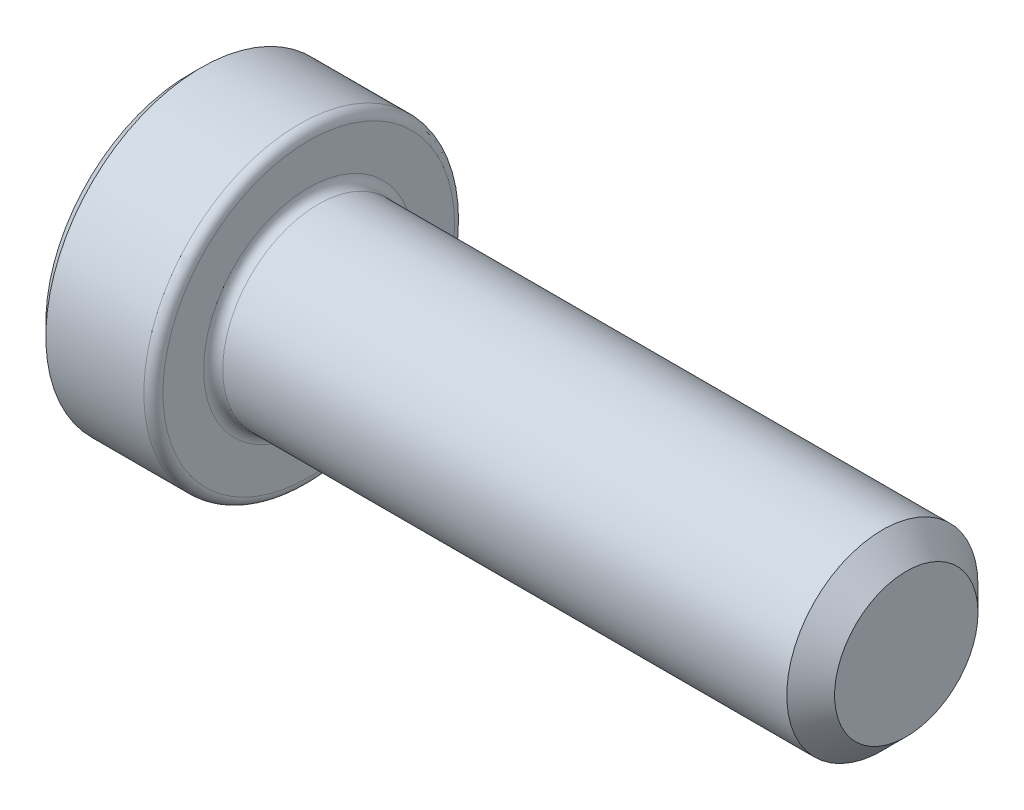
ISO-10303-21;
HEADER;
FILE_DESCRIPTION(('STEP AP214'),'2;1');
FILE_NAME('part.step','',(''),(''),'','','');
FILE_SCHEMA(('AUTOMOTIVE_DESIGN { 1 0 10303 214 1 1 1 1 }'));
ENDSEC;
DATA;
#1=APPLICATION_CONTEXT('core data for automotive mechanical design processes');
#2=APPLICATION_PROTOCOL_DEFINITION('international standard','automotive_design',2000,#1);
#3=PRODUCT_CONTEXT('',#1,'mechanical');
#4=PRODUCT('Part','Part','',(#3));
#5=PRODUCT_RELATED_PRODUCT_CATEGORY('part','',(#4));
#6=PRODUCT_DEFINITION_FORMATION('','',#4);
#7=PRODUCT_DEFINITION_CONTEXT('part definition',#1,'design');
#8=PRODUCT_DEFINITION('design','',#6,#7);
#9=PRODUCT_DEFINITION_SHAPE('','',#8);
#10=(LENGTH_UNIT() NAMED_UNIT(*) SI_UNIT(.MILLI.,.METRE.));
#11=(NAMED_UNIT(*) PLANE_ANGLE_UNIT() SI_UNIT($,.RADIAN.));
#12=(NAMED_UNIT(*) SI_UNIT($,.STERADIAN.) SOLID_ANGLE_UNIT());
#13=UNCERTAINTY_MEASURE_WITH_UNIT(LENGTH_MEASURE(1.E-05),#10,'distance_accuracy_value','');
#14=(GEOMETRIC_REPRESENTATION_CONTEXT(3) GLOBAL_UNCERTAINTY_ASSIGNED_CONTEXT((#13)) GLOBAL_UNIT_ASSIGNED_CONTEXT((#10,
#11,#12)) REPRESENTATION_CONTEXT('',''));
#15=CARTESIAN_POINT('',(0.,0.,0.));
#16=DIRECTION('',(0.,0.,1.));
#17=DIRECTION('',(1.,0.,0.));
#18=AXIS2_PLACEMENT_3D('',#15,#16,#17);
#19=CARTESIAN_POINT('',(-30.,0.,0.));
#20=DIRECTION('',(1.,0.,0.));
#21=DIRECTION('',(0.,0.,-1.));
#22=AXIS2_PLACEMENT_3D('',#19,#20,#21);
#23=PLANE('',#22);
#24=DIRECTION('',(0.,-0.866025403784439,0.5));
#25=VECTOR('',#24,1.);
#26=CARTESIAN_POINT('',(-30.,-3.,-1.73205080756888));
#27=LINE('',#26,#25);
#28=CARTESIAN_POINT('',(-30.,0.,-3.46410161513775));
#29=VERTEX_POINT('',#28);
#30=CARTESIAN_POINT('',(-30.,-3.,-1.73205080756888));
#31=VERTEX_POINT('',#30);
#32=EDGE_CURVE('E115',#29,#31,#27,.T.);
#33=ORIENTED_EDGE('',*,*,#32,.F.);
#34=DIRECTION('',(0.,-0.866025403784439,-0.5));
#35=VECTOR('',#34,1.);
#36=CARTESIAN_POINT('',(-30.,0.,-3.46410161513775));
#37=LINE('',#36,#35);
#38=CARTESIAN_POINT('',(-30.,3.,-1.73205080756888));
#39=VERTEX_POINT('',#38);
#40=EDGE_CURVE('E120',#39,#29,#37,.T.);
#41=ORIENTED_EDGE('',*,*,#40,.F.);
#42=DIRECTION('',(0.,0.,-1.));
#43=VECTOR('',#42,1.);
#44=CARTESIAN_POINT('',(-30.,3.,-1.73205080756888));
#45=LINE('',#44,#43);
#46=CARTESIAN_POINT('',(-30.,3.,1.73205080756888));
#47=VERTEX_POINT('',#46);
#48=EDGE_CURVE('E133',#47,#39,#45,.T.);
#49=ORIENTED_EDGE('',*,*,#48,.F.);
#50=DIRECTION('',(0.,0.866025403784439,-0.5));
#51=VECTOR('',#50,1.);
#52=CARTESIAN_POINT('',(-30.,3.,1.73205080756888));
#53=LINE('',#52,#51);
#54=CARTESIAN_POINT('',(-30.,0.,3.46410161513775));
#55=VERTEX_POINT('',#54);
#56=EDGE_CURVE('E127',#55,#47,#53,.T.);
#57=ORIENTED_EDGE('',*,*,#56,.F.);
#58=DIRECTION('',(0.,0.866025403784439,0.5));
#59=VECTOR('',#58,1.);
#60=CARTESIAN_POINT('',(-30.,0.,3.46410161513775));
#61=LINE('',#60,#59);
#62=CARTESIAN_POINT('',(-30.,-3.,1.73205080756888));
#63=VERTEX_POINT('',#62);
#64=EDGE_CURVE('E125',#63,#55,#61,.T.);
#65=ORIENTED_EDGE('',*,*,#64,.F.);
#66=DIRECTION('',(0.,0.,1.));
#67=VECTOR('',#66,1.);
#68=CARTESIAN_POINT('',(-30.,-3.,1.73205080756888));
#69=LINE('',#68,#67);
#70=EDGE_CURVE('E105',#31,#63,#69,.T.);
#71=ORIENTED_EDGE('',*,*,#70,.F.);
#72=EDGE_LOOP('',(#33,#41,#49,#57,#65,#71));
#73=FACE_BOUND('',#72,.T.);
#74=CARTESIAN_POINT('',(-30.,0.,0.));
#75=DIRECTION('',(1.,0.,0.));
#76=DIRECTION('',(0.,0.,-1.));
#77=AXIS2_PLACEMENT_3D('',#74,#75,#76);
#78=CIRCLE('',#77,6.);
#79=CARTESIAN_POINT('',(-30.,0.,-6.));
#80=VERTEX_POINT('',#79);
#81=EDGE_CURVE('E165',#80,#80,#78,.T.);
#82=ORIENTED_EDGE('',*,*,#81,.F.);
#83=EDGE_LOOP('',(#82));
#84=FACE_BOUND('',#83,.T.);
#85=ADVANCED_FACE('F32',(#73,#84),#23,.F.);
#86=CARTESIAN_POINT('',(-30.,0.,0.));
#87=DIRECTION('',(1.,0.,0.));
#88=DIRECTION('',(0.,0.,-1.));
#89=AXIS2_PLACEMENT_3D('',#86,#87,#88);
#90=CONICAL_SURFACE('',#89,6.,0.785398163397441);
#91=CARTESIAN_POINT('',(-29.5,0.,0.));
#92=DIRECTION('',(1.,0.,0.));
#93=DIRECTION('',(0.,0.,-1.));
#94=AXIS2_PLACEMENT_3D('',#91,#92,#93);
#95=CIRCLE('',#94,6.5);
#96=CARTESIAN_POINT('',(-29.5,0.,-6.5));
#97=VERTEX_POINT('',#96);
#98=EDGE_CURVE('E162',#97,#97,#95,.T.);
#99=ORIENTED_EDGE('',*,*,#98,.F.);
#100=EDGE_LOOP('',(#99));
#101=FACE_BOUND('',#100,.T.);
#102=ORIENTED_EDGE('',*,*,#81,.T.);
#103=EDGE_LOOP('',(#102));
#104=FACE_BOUND('',#103,.T.);
#105=ADVANCED_FACE('F249',(#101,#104),#90,.T.);
#106=CARTESIAN_POINT('',(0.,0.,0.));
#107=DIRECTION('',(1.,0.,0.));
#108=DIRECTION('',(0.,0.,-1.));
#109=AXIS2_PLACEMENT_3D('',#106,#107,#108);
#110=CYLINDRICAL_SURFACE('',#109,6.5);
#111=CARTESIAN_POINT('',(-25.4,0.,0.));
#112=DIRECTION('',(1.,0.,0.));
#113=DIRECTION('',(0.,0.,-1.));
#114=AXIS2_PLACEMENT_3D('',#111,#112,#113);
#115=CIRCLE('',#114,6.5);
#116=CARTESIAN_POINT('',(-25.4,0.,-6.5));
#117=VERTEX_POINT('',#116);
#118=EDGE_CURVE('E159',#117,#117,#115,.T.);
#119=ORIENTED_EDGE('',*,*,#118,.F.);
#120=EDGE_LOOP('',(#119));
#121=FACE_BOUND('',#120,.T.);
#122=ORIENTED_EDGE('',*,*,#98,.T.);
#123=EDGE_LOOP('',(#122));
#124=FACE_BOUND('',#123,.T.);
#125=ADVANCED_FACE('F253',(#121,#124),#110,.T.);
#126=CARTESIAN_POINT('',(-25.4,0.,0.));
#127=DIRECTION('',(1.,0.,0.));
#128=DIRECTION('',(0.,0.,-1.));
#129=AXIS2_PLACEMENT_3D('',#126,#127,#128);
#130=TOROIDAL_SURFACE('',#129,6.1,0.399999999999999);
#131=CARTESIAN_POINT('',(-25.,0.,0.));
#132=DIRECTION('',(1.,0.,0.));
#133=DIRECTION('',(0.,0.,-1.));
#134=AXIS2_PLACEMENT_3D('',#131,#132,#133);
#135=CIRCLE('',#134,6.1);
#136=CARTESIAN_POINT('',(-25.,0.,-6.1));
#137=VERTEX_POINT('',#136);
#138=EDGE_CURVE('E156',#137,#137,#135,.T.);
#139=ORIENTED_EDGE('',*,*,#138,.F.);
#140=EDGE_LOOP('',(#139));
#141=FACE_BOUND('',#140,.T.);
#142=ORIENTED_EDGE('',*,*,#118,.T.);
#143=EDGE_LOOP('',(#142));
#144=FACE_BOUND('',#143,.T.);
#145=ADVANCED_FACE('F258',(#141,#144),#130,.T.);
#146=CARTESIAN_POINT('',(-25.,6.1,0.));
#147=DIRECTION('',(-1.,0.,0.));
#148=DIRECTION('',(0.,0.,1.));
#149=AXIS2_PLACEMENT_3D('',#146,#147,#148);
#150=PLANE('',#149);
#151=CARTESIAN_POINT('',(-25.,0.,0.));
#152=DIRECTION('',(1.,0.,0.));
#153=DIRECTION('',(0.,0.,-1.));
#154=AXIS2_PLACEMENT_3D('',#151,#152,#153);
#155=CIRCLE('',#154,4.4);
#156=CARTESIAN_POINT('',(-25.,0.,-4.4));
#157=VERTEX_POINT('',#156);
#158=EDGE_CURVE('E153',#157,#157,#155,.T.);
#159=ORIENTED_EDGE('',*,*,#158,.F.);
#160=EDGE_LOOP('',(#159));
#161=FACE_BOUND('',#160,.T.);
#162=ORIENTED_EDGE('',*,*,#138,.T.);
#163=EDGE_LOOP('',(#162));
#164=FACE_BOUND('',#163,.T.);
#165=ADVANCED_FACE('F266',(#161,#164),#150,.F.);
#166=CARTESIAN_POINT('',(-24.6,0.,0.));
#167=DIRECTION('',(1.,0.,0.));
#168=DIRECTION('',(0.,0.,-1.));
#169=AXIS2_PLACEMENT_3D('',#166,#167,#168);
#170=TOROIDAL_SURFACE('',#169,4.4,0.400000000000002);
#171=CARTESIAN_POINT('',(-24.6,0.,0.));
#172=DIRECTION('',(1.,0.,0.));
#173=DIRECTION('',(0.,0.,-1.));
#174=AXIS2_PLACEMENT_3D('',#171,#172,#173);
#175=CIRCLE('',#174,4.);
#176=CARTESIAN_POINT('',(-24.6,0.,-4.));
#177=VERTEX_POINT('',#176);
#178=EDGE_CURVE('E150',#177,#177,#175,.T.);
#179=ORIENTED_EDGE('',*,*,#178,.F.);
#180=EDGE_LOOP('',(#179));
#181=FACE_BOUND('',#180,.T.);
#182=ORIENTED_EDGE('',*,*,#158,.T.);
#183=EDGE_LOOP('',(#182));
#184=FACE_BOUND('',#183,.T.);
#185=ADVANCED_FACE('F270',(#181,#184),#170,.F.);
#186=CARTESIAN_POINT('',(0.,0.,0.));
#187=DIRECTION('',(1.,0.,0.));
#188=DIRECTION('',(0.,0.,-1.));
#189=AXIS2_PLACEMENT_3D('',#186,#187,#188);
#190=CYLINDRICAL_SURFACE('',#189,4.);
#191=CARTESIAN_POINT('',(-1.,0.,0.));
#192=DIRECTION('',(1.,0.,0.));
#193=DIRECTION('',(0.,0.,-1.));
#194=AXIS2_PLACEMENT_3D('',#191,#192,#193);
#195=CIRCLE('',#194,4.);
#196=CARTESIAN_POINT('',(-1.,0.,-4.));
#197=VERTEX_POINT('',#196);
#198=EDGE_CURVE('E147',#197,#197,#195,.T.);
#199=ORIENTED_EDGE('',*,*,#198,.F.);
#200=EDGE_LOOP('',(#199));
#201=FACE_BOUND('',#200,.T.);
#202=ORIENTED_EDGE('',*,*,#178,.T.);
#203=EDGE_LOOP('',(#202));
#204=FACE_BOUND('',#203,.T.);
#205=ADVANCED_FACE('F274',(#201,#204),#190,.T.);
#206=CARTESIAN_POINT('',(-1.,0.,0.));
#207=DIRECTION('',(-1.,0.,0.));
#208=DIRECTION('',(0.,0.,1.));
#209=AXIS2_PLACEMENT_3D('',#206,#207,#208);
#210=CONICAL_SURFACE('',#209,4.,0.785398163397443);
#211=CARTESIAN_POINT('',(0.,0.,0.));
#212=DIRECTION('',(1.,0.,0.));
#213=DIRECTION('',(0.,0.,-1.));
#214=AXIS2_PLACEMENT_3D('',#211,#212,#213);
#215=CIRCLE('',#214,3.00000000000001);
#216=CARTESIAN_POINT('',(0.,0.,-3.00000000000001));
#217=VERTEX_POINT('',#216);
#218=EDGE_CURVE('E138',#217,#217,#215,.T.);
#219=ORIENTED_EDGE('',*,*,#218,.F.);
#220=EDGE_LOOP('',(#219));
#221=FACE_BOUND('',#220,.T.);
#222=ORIENTED_EDGE('',*,*,#198,.T.);
#223=EDGE_LOOP('',(#222));
#224=FACE_BOUND('',#223,.T.);
#225=ADVANCED_FACE('F278',(#221,#224),#210,.T.);
#226=CARTESIAN_POINT('',(0.,3.00000000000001,0.));
#227=DIRECTION('',(-1.,0.,0.));
#228=DIRECTION('',(0.,0.,1.));
#229=AXIS2_PLACEMENT_3D('',#226,#227,#228);
#230=PLANE('',#229);
#231=ORIENTED_EDGE('',*,*,#218,.T.);
#232=EDGE_LOOP('',(#231));
#233=FACE_BOUND('',#232,.T.);
#234=ADVANCED_FACE('F282',(#233),#230,.F.);
#235=CARTESIAN_POINT('',(-27.,0.,-3.46410161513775));
#236=DIRECTION('',(0.,0.5,-0.866025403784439));
#237=DIRECTION('',(0.,0.866025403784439,0.5));
#238=AXIS2_PLACEMENT_3D('',#235,#236,#237);
#239=PLANE('',#238);
#240=DIRECTION('',(-1.,0.,0.));
#241=VECTOR('',#240,1.);
#242=CARTESIAN_POINT('',(-27.,0.,-3.46410161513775));
#243=LINE('',#242,#241);
#244=CARTESIAN_POINT('',(-28.1547005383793,0.,-3.46410161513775));
#245=VERTEX_POINT('',#244);
#246=EDGE_CURVE('E112',#245,#29,#243,.T.);
#247=ORIENTED_EDGE('',*,*,#246,.F.);
#248=DIRECTION('',(0.,0.866025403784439,0.5));
#249=VECTOR('',#248,1.);
#250=CARTESIAN_POINT('',(-28.1547005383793,3.,-1.73205080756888));
#251=LINE('',#250,#249);
#252=CARTESIAN_POINT('',(-28.1547005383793,3.,-1.73205080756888));
#253=VERTEX_POINT('',#252);
#254=EDGE_CURVE('E11',#245,#253,#251,.T.);
#255=ORIENTED_EDGE('',*,*,#254,.T.);
#256=DIRECTION('',(-1.,0.,0.));
#257=VECTOR('',#256,1.);
#258=CARTESIAN_POINT('',(-27.,3.,-1.73205080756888));
#259=LINE('',#258,#257);
#260=EDGE_CURVE('E136',#253,#39,#259,.T.);
#261=ORIENTED_EDGE('',*,*,#260,.T.);
#262=ORIENTED_EDGE('',*,*,#40,.T.);
#263=EDGE_LOOP('',(#247,#255,#261,#262));
#264=FACE_BOUND('',#263,.T.);
#265=ADVANCED_FACE('F220',(#264),#239,.F.);
#266=CARTESIAN_POINT('',(-27.,3.,-1.73205080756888));
#267=DIRECTION('',(0.,1.,0.));
#268=DIRECTION('',(0.,0.,1.));
#269=AXIS2_PLACEMENT_3D('',#266,#267,#268);
#270=PLANE('',#269);
#271=ORIENTED_EDGE('',*,*,#260,.F.);
#272=DIRECTION('',(0.,0.,1.));
#273=VECTOR('',#272,1.);
#274=CARTESIAN_POINT('',(-28.1547005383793,3.,1.73205080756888));
#275=LINE('',#274,#273);
#276=CARTESIAN_POINT('',(-28.1547005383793,3.,1.73205080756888));
#277=VERTEX_POINT('',#276);
#278=EDGE_CURVE('E39',#253,#277,#275,.T.);
#279=ORIENTED_EDGE('',*,*,#278,.T.);
#280=DIRECTION('',(-1.,0.,0.));
#281=VECTOR('',#280,1.);
#282=CARTESIAN_POINT('',(-27.,3.,1.73205080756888));
#283=LINE('',#282,#281);
#284=EDGE_CURVE('E139',#277,#47,#283,.T.);
#285=ORIENTED_EDGE('',*,*,#284,.T.);
#286=ORIENTED_EDGE('',*,*,#48,.T.);
#287=EDGE_LOOP('',(#271,#279,#285,#286));
#288=FACE_BOUND('',#287,.T.);
#289=ADVANCED_FACE('F222',(#288),#270,.F.);
#290=CARTESIAN_POINT('',(-27.,3.,1.73205080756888));
#291=DIRECTION('',(0.,0.5,0.866025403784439));
#292=DIRECTION('',(0.,-0.866025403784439,0.5));
#293=AXIS2_PLACEMENT_3D('',#290,#291,#292);
#294=PLANE('',#293);
#295=ORIENTED_EDGE('',*,*,#284,.F.);
#296=DIRECTION('',(0.,-0.866025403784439,0.5));
#297=VECTOR('',#296,1.);
#298=CARTESIAN_POINT('',(-28.1547005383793,0.,3.46410161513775));
#299=LINE('',#298,#297);
#300=CARTESIAN_POINT('',(-28.1547005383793,0.,3.46410161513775));
#301=VERTEX_POINT('',#300);
#302=EDGE_CURVE('E187',#277,#301,#299,.T.);
#303=ORIENTED_EDGE('',*,*,#302,.T.);
#304=DIRECTION('',(-1.,0.,0.));
#305=VECTOR('',#304,1.);
#306=CARTESIAN_POINT('',(-27.,0.,3.46410161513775));
#307=LINE('',#306,#305);
#308=EDGE_CURVE('E141',#301,#55,#307,.T.);
#309=ORIENTED_EDGE('',*,*,#308,.T.);
#310=ORIENTED_EDGE('',*,*,#56,.T.);
#311=EDGE_LOOP('',(#295,#303,#309,#310));
#312=FACE_BOUND('',#311,.T.);
#313=ADVANCED_FACE('F191',(#312),#294,.F.);
#314=CARTESIAN_POINT('',(-27.,0.,3.46410161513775));
#315=DIRECTION('',(0.,-0.5,0.866025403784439));
#316=DIRECTION('',(0.,-0.866025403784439,-0.5));
#317=AXIS2_PLACEMENT_3D('',#314,#315,#316);
#318=PLANE('',#317);
#319=ORIENTED_EDGE('',*,*,#308,.F.);
#320=DIRECTION('',(0.,-0.866025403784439,-0.5));
#321=VECTOR('',#320,1.);
#322=CARTESIAN_POINT('',(-28.1547005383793,-3.,1.73205080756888));
#323=LINE('',#322,#321);
#324=CARTESIAN_POINT('',(-28.1547005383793,-3.,1.73205080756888));
#325=VERTEX_POINT('',#324);
#326=EDGE_CURVE('E181',#301,#325,#323,.T.);
#327=ORIENTED_EDGE('',*,*,#326,.T.);
#328=DIRECTION('',(-1.,0.,0.));
#329=VECTOR('',#328,1.);
#330=CARTESIAN_POINT('',(-27.,-3.,1.73205080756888));
#331=LINE('',#330,#329);
#332=EDGE_CURVE('E111',#325,#63,#331,.T.);
#333=ORIENTED_EDGE('',*,*,#332,.T.);
#334=ORIENTED_EDGE('',*,*,#64,.T.);
#335=EDGE_LOOP('',(#319,#327,#333,#334));
#336=FACE_BOUND('',#335,.T.);
#337=ADVANCED_FACE('F198',(#336),#318,.F.);
#338=CARTESIAN_POINT('',(-27.,-3.,1.73205080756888));
#339=DIRECTION('',(0.,-1.,0.));
#340=DIRECTION('',(0.,0.,-1.));
#341=AXIS2_PLACEMENT_3D('',#338,#339,#340);
#342=PLANE('',#341);
#343=ORIENTED_EDGE('',*,*,#332,.F.);
#344=DIRECTION('',(0.,0.,-1.));
#345=VECTOR('',#344,1.);
#346=CARTESIAN_POINT('',(-28.1547005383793,-3.,-1.73205080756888));
#347=LINE('',#346,#345);
#348=CARTESIAN_POINT('',(-28.1547005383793,-3.,-1.73205080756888));
#349=VERTEX_POINT('',#348);
#350=EDGE_CURVE('E108',#325,#349,#347,.T.);
#351=ORIENTED_EDGE('',*,*,#350,.T.);
#352=DIRECTION('',(-1.,0.,0.));
#353=VECTOR('',#352,1.);
#354=CARTESIAN_POINT('',(-27.,-3.,-1.73205080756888));
#355=LINE('',#354,#353);
#356=EDGE_CURVE('E100',#349,#31,#355,.T.);
#357=ORIENTED_EDGE('',*,*,#356,.T.);
#358=ORIENTED_EDGE('',*,*,#70,.T.);
#359=EDGE_LOOP('',(#343,#351,#357,#358));
#360=FACE_BOUND('',#359,.T.);
#361=ADVANCED_FACE('F103',(#360),#342,.F.);
#362=CARTESIAN_POINT('',(-27.,-3.,-1.73205080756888));
#363=DIRECTION('',(0.,-0.5,-0.866025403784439));
#364=DIRECTION('',(0.,0.866025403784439,-0.5));
#365=AXIS2_PLACEMENT_3D('',#362,#363,#364);
#366=PLANE('',#365);
#367=ORIENTED_EDGE('',*,*,#356,.F.);
#368=DIRECTION('',(0.,0.866025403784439,-0.5));
#369=VECTOR('',#368,1.);
#370=CARTESIAN_POINT('',(-28.1547005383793,0.,-3.46410161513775));
#371=LINE('',#370,#369);
#372=EDGE_CURVE('E185',#349,#245,#371,.T.);
#373=ORIENTED_EDGE('',*,*,#372,.T.);
#374=ORIENTED_EDGE('',*,*,#246,.T.);
#375=ORIENTED_EDGE('',*,*,#32,.T.);
#376=EDGE_LOOP('',(#367,#373,#374,#375));
#377=FACE_BOUND('',#376,.T.);
#378=ADVANCED_FACE('F116',(#377),#366,.F.);
#379=CARTESIAN_POINT('',(-27.,3.,-1.73205080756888));
#380=DIRECTION('',(1.,0.,0.));
#381=DIRECTION('',(0.,0.,-1.));
#382=AXIS2_PLACEMENT_3D('',#379,#380,#381);
#383=PLANE('',#382);
#384=DIRECTION('',(0.,0.,1.));
#385=VECTOR('',#384,1.);
#386=CARTESIAN_POINT('',(-27.,-1.00000000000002,1.73205080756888));
#387=LINE('',#386,#385);
#388=CARTESIAN_POINT('',(-27.,-1.00000000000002,-0.577350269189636));
#389=VERTEX_POINT('',#388);
#390=CARTESIAN_POINT('',(-27.,-1.00000000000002,0.577350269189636));
#391=VERTEX_POINT('',#390);
#392=EDGE_CURVE('E176',#389,#391,#387,.T.);
#393=ORIENTED_EDGE('',*,*,#392,.T.);
#394=DIRECTION('',(0.,0.866025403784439,0.5));
#395=VECTOR('',#394,1.);
#396=CARTESIAN_POINT('',(-27.,0.999999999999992,1.73205080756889));
#397=LINE('',#396,#395);
#398=CARTESIAN_POINT('',(-27.,0.,1.15470053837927));
#399=VERTEX_POINT('',#398);
#400=EDGE_CURVE('E178',#391,#399,#397,.T.);
#401=ORIENTED_EDGE('',*,*,#400,.T.);
#402=DIRECTION('',(0.,0.866025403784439,-0.5));
#403=VECTOR('',#402,1.);
#404=CARTESIAN_POINT('',(-27.,2.00000000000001,0.));
#405=LINE('',#404,#403);
#406=CARTESIAN_POINT('',(-27.,1.00000000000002,0.577350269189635));
#407=VERTEX_POINT('',#406);
#408=EDGE_CURVE('E172',#399,#407,#405,.T.);
#409=ORIENTED_EDGE('',*,*,#408,.T.);
#410=DIRECTION('',(0.,0.,-1.));
#411=VECTOR('',#410,1.);
#412=CARTESIAN_POINT('',(-27.,1.00000000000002,-1.73205080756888));
#413=LINE('',#412,#411);
#414=CARTESIAN_POINT('',(-27.,1.00000000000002,-0.577350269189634));
#415=VERTEX_POINT('',#414);
#416=EDGE_CURVE('E170',#407,#415,#413,.T.);
#417=ORIENTED_EDGE('',*,*,#416,.T.);
#418=DIRECTION('',(0.,-0.866025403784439,-0.5));
#419=VECTOR('',#418,1.);
#420=CARTESIAN_POINT('',(-27.,-0.999999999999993,-1.73205080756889));
#421=LINE('',#420,#419);
#422=CARTESIAN_POINT('',(-27.,0.,-1.15470053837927));
#423=VERTEX_POINT('',#422);
#424=EDGE_CURVE('E168',#415,#423,#421,.T.);
#425=ORIENTED_EDGE('',*,*,#424,.T.);
#426=DIRECTION('',(0.,-0.866025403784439,0.5));
#427=VECTOR('',#426,1.);
#428=CARTESIAN_POINT('',(-27.,-2.00000000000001,0.));
#429=LINE('',#428,#427);
#430=EDGE_CURVE('E174',#423,#389,#429,.T.);
#431=ORIENTED_EDGE('',*,*,#430,.T.);
#432=EDGE_LOOP('',(#393,#401,#409,#417,#425,#431));
#433=FACE_BOUND('',#432,.T.);
#434=ADVANCED_FACE('F232',(#433),#383,.F.);
#435=CARTESIAN_POINT('',(-27.,2.00000000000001,0.));
#436=DIRECTION('',(-0.866025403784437,-0.250000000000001,0.433012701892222));
#437=DIRECTION('',(0.447213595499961,0.,0.894427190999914));
#438=AXIS2_PLACEMENT_3D('',#435,#436,#437);
#439=PLANE('',#438);
#440=DIRECTION('',(-0.447213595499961,0.774596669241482,-0.447213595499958));
#441=VECTOR('',#440,1.);
#442=CARTESIAN_POINT('',(-27.2309401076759,1.40000000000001,-0.808290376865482));
#443=LINE('',#442,#441);
#444=EDGE_CURVE('E215',#253,#415,#443,.F.);
#445=ORIENTED_EDGE('',*,*,#444,.F.);
#446=ORIENTED_EDGE('',*,*,#254,.F.);
#447=DIRECTION('',(0.447213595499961,0.,0.894427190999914));
#448=VECTOR('',#447,1.);
#449=CARTESIAN_POINT('',(-27.5773502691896,0.,-2.30940107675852));
#450=LINE('',#449,#448);
#451=EDGE_CURVE('E218',#423,#245,#450,.F.);
#452=ORIENTED_EDGE('',*,*,#451,.F.);
#453=ORIENTED_EDGE('',*,*,#424,.F.);
#454=EDGE_LOOP('',(#445,#446,#452,#453));
#455=FACE_BOUND('',#454,.T.);
#456=ADVANCED_FACE('F226',(#455),#439,.T.);
#457=CARTESIAN_POINT('',(-27.,2.49999999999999,-2.59807621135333));
#458=DIRECTION('',(-0.866025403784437,0.250000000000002,0.433012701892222));
#459=DIRECTION('',(0.447213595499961,0.,0.894427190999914));
#460=AXIS2_PLACEMENT_3D('',#457,#458,#459);
#461=PLANE('',#460);
#462=ORIENTED_EDGE('',*,*,#451,.T.);
#463=ORIENTED_EDGE('',*,*,#372,.F.);
#464=DIRECTION('',(0.447213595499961,0.774596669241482,0.447213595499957));
#465=VECTOR('',#464,1.);
#466=CARTESIAN_POINT('',(-27.2309401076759,-1.40000000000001,-0.808290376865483));
#467=LINE('',#466,#465);
#468=EDGE_CURVE('E212',#389,#349,#467,.F.);
#469=ORIENTED_EDGE('',*,*,#468,.F.);
#470=ORIENTED_EDGE('',*,*,#430,.F.);
#471=EDGE_LOOP('',(#462,#463,#469,#470));
#472=FACE_BOUND('',#471,.T.);
#473=ADVANCED_FACE('F239',(#472),#461,.T.);
#474=CARTESIAN_POINT('',(-27.,1.00000000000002,-1.73205080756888));
#475=DIRECTION('',(-0.866025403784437,-0.500000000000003,0.));
#476=DIRECTION('',(0.500000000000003,-0.866025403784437,0.));
#477=AXIS2_PLACEMENT_3D('',#474,#475,#476);
#478=PLANE('',#477);
#479=ORIENTED_EDGE('',*,*,#444,.T.);
#480=ORIENTED_EDGE('',*,*,#416,.F.);
#481=DIRECTION('',(-0.447213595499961,0.774596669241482,0.447213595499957));
#482=VECTOR('',#481,1.);
#483=CARTESIAN_POINT('',(-27.5773502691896,2.00000000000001,1.15470053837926));
#484=LINE('',#483,#482);
#485=EDGE_CURVE('E208',#277,#407,#484,.F.);
#486=ORIENTED_EDGE('',*,*,#485,.F.);
#487=ORIENTED_EDGE('',*,*,#278,.F.);
#488=EDGE_LOOP('',(#479,#480,#486,#487));
#489=FACE_BOUND('',#488,.T.);
#490=ADVANCED_FACE('F230',(#489),#478,.T.);
#491=CARTESIAN_POINT('',(-27.,-1.00000000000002,-1.73205080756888));
#492=DIRECTION('',(-0.866025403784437,0.500000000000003,0.));
#493=DIRECTION('',(-0.500000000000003,-0.866025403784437,0.));
#494=AXIS2_PLACEMENT_3D('',#491,#492,#493);
#495=PLANE('',#494);
#496=ORIENTED_EDGE('',*,*,#468,.T.);
#497=ORIENTED_EDGE('',*,*,#350,.F.);
#498=DIRECTION('',(0.447213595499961,0.774596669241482,-0.447213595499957));
#499=VECTOR('',#498,1.);
#500=CARTESIAN_POINT('',(-26.5381197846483,-0.200000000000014,0.115470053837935));
#501=LINE('',#500,#499);
#502=EDGE_CURVE('E205',#391,#325,#501,.F.);
#503=ORIENTED_EDGE('',*,*,#502,.F.);
#504=ORIENTED_EDGE('',*,*,#392,.F.);
#505=EDGE_LOOP('',(#496,#497,#503,#504));
#506=FACE_BOUND('',#505,.T.);
#507=ADVANCED_FACE('F237',(#506),#495,.T.);
#508=CARTESIAN_POINT('',(-27.,3.50000000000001,-0.866025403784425));
#509=DIRECTION('',(-0.866025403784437,-0.250000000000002,-0.433012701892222));
#510=DIRECTION('',(-0.447213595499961,0.,0.894427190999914));
#511=AXIS2_PLACEMENT_3D('',#508,#509,#510);
#512=PLANE('',#511);
#513=ORIENTED_EDGE('',*,*,#485,.T.);
#514=ORIENTED_EDGE('',*,*,#408,.F.);
#515=DIRECTION('',(-0.447213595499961,0.,0.894427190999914));
#516=VECTOR('',#515,1.);
#517=CARTESIAN_POINT('',(-27.2309401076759,0.,1.61658075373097));
#518=LINE('',#517,#516);
#519=EDGE_CURVE('E202',#301,#399,#518,.F.);
#520=ORIENTED_EDGE('',*,*,#519,.F.);
#521=ORIENTED_EDGE('',*,*,#302,.F.);
#522=EDGE_LOOP('',(#513,#514,#520,#521));
#523=FACE_BOUND('',#522,.T.);
#524=ADVANCED_FACE('F206',(#523),#512,.T.);
#525=CARTESIAN_POINT('',(-27.,0.999999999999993,1.73205080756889));
#526=DIRECTION('',(-0.866025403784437,0.250000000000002,-0.433012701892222));
#527=DIRECTION('',(-0.447213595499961,0.,0.894427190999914));
#528=AXIS2_PLACEMENT_3D('',#525,#526,#527);
#529=PLANE('',#528);
#530=ORIENTED_EDGE('',*,*,#502,.T.);
#531=ORIENTED_EDGE('',*,*,#326,.F.);
#532=ORIENTED_EDGE('',*,*,#519,.T.);
#533=ORIENTED_EDGE('',*,*,#400,.F.);
#534=EDGE_LOOP('',(#530,#531,#532,#533));
#535=FACE_BOUND('',#534,.T.);
#536=ADVANCED_FACE('F200',(#535),#529,.T.);
#537=CLOSED_SHELL('',(#85,#105,#125,#145,#165,#185,#205,#225,#234,#265,#289,#313,#337,#361,#378,
#434,#456,#473,#490,#507,#524,#536));
#538=MANIFOLD_SOLID_BREP('B2',#537);
#539=ADVANCED_BREP_SHAPE_REPRESENTATION('',(#18,#538),#14);
#540=SHAPE_DEFINITION_REPRESENTATION(#9,#539);
ENDSEC;
END-ISO-10303-21;
